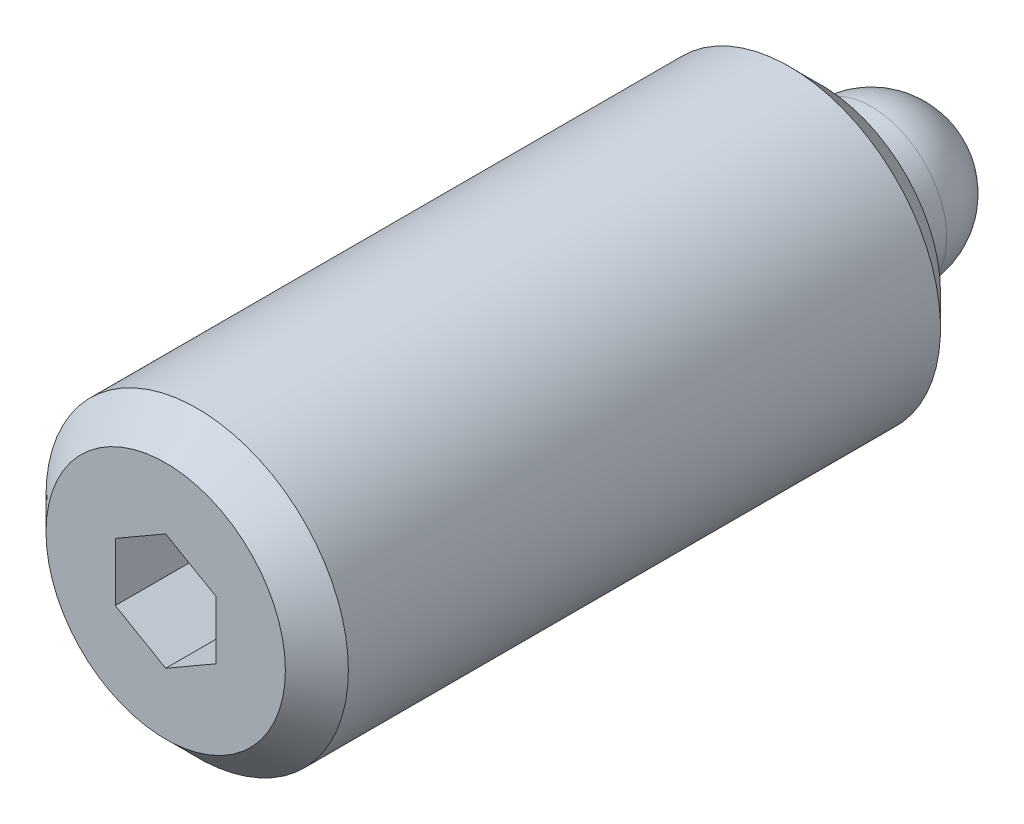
ISO-10303-21;
HEADER;
FILE_DESCRIPTION(('STEP AP214'),'2;1');
FILE_NAME('part.step','',(''),(''),'','','');
FILE_SCHEMA(('AUTOMOTIVE_DESIGN { 1 0 10303 214 1 1 1 1 }'));
ENDSEC;
DATA;
#1=APPLICATION_CONTEXT('core data for automotive mechanical design processes');
#2=APPLICATION_PROTOCOL_DEFINITION('international standard','automotive_design',2000,#1);
#3=PRODUCT_CONTEXT('',#1,'mechanical');
#4=PRODUCT('Part','Part','',(#3));
#5=PRODUCT_RELATED_PRODUCT_CATEGORY('part','',(#4));
#6=PRODUCT_DEFINITION_FORMATION('','',#4);
#7=PRODUCT_DEFINITION_CONTEXT('part definition',#1,'design');
#8=PRODUCT_DEFINITION('design','',#6,#7);
#9=PRODUCT_DEFINITION_SHAPE('','',#8);
#10=(LENGTH_UNIT() NAMED_UNIT(*) SI_UNIT(.MILLI.,.METRE.));
#11=(NAMED_UNIT(*) PLANE_ANGLE_UNIT() SI_UNIT($,.RADIAN.));
#12=(NAMED_UNIT(*) SI_UNIT($,.STERADIAN.) SOLID_ANGLE_UNIT());
#13=UNCERTAINTY_MEASURE_WITH_UNIT(LENGTH_MEASURE(1.E-05),#10,'distance_accuracy_value','');
#14=(GEOMETRIC_REPRESENTATION_CONTEXT(3) GLOBAL_UNCERTAINTY_ASSIGNED_CONTEXT((#13)) GLOBAL_UNIT_ASSIGNED_CONTEXT((#10,
#11,#12)) REPRESENTATION_CONTEXT('',''));
#15=CARTESIAN_POINT('',(0.,0.,0.));
#16=DIRECTION('',(0.,0.,1.));
#17=DIRECTION('',(1.,0.,0.));
#18=AXIS2_PLACEMENT_3D('',#15,#16,#17);
#19=CARTESIAN_POINT('',(0.,12.,62.));
#20=DIRECTION('',(0.,0.,1.));
#21=DIRECTION('',(1.,0.,0.));
#22=AXIS2_PLACEMENT_3D('',#19,#20,#21);
#23=PLANE('',#22);
#24=CARTESIAN_POINT('',(0.,0.,62.));
#25=DIRECTION('',(0.,0.,1.));
#26=DIRECTION('',(1.,0.,0.));
#27=AXIS2_PLACEMENT_3D('',#24,#25,#26);
#28=CIRCLE('',#27,9.5);
#29=CARTESIAN_POINT('',(9.5,0.,62.));
#30=VERTEX_POINT('',#29);
#31=EDGE_CURVE('E9',#30,#30,#28,.T.);
#32=ORIENTED_EDGE('',*,*,#31,.T.);
#33=EDGE_LOOP('',(#32));
#34=FACE_BOUND('',#33,.T.);
#35=DIRECTION('',(0.866025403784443,-0.499999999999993,0.));
#36=VECTOR('',#35,1.);
#37=CARTESIAN_POINT('',(-4.,-2.30940107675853,62.));
#38=LINE('',#37,#36);
#39=CARTESIAN_POINT('',(-4.,-2.30940107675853,62.));
#40=VERTEX_POINT('',#39);
#41=CARTESIAN_POINT('',(0.,-4.61880215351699,62.));
#42=VERTEX_POINT('',#41);
#43=EDGE_CURVE('E84',#40,#42,#38,.T.);
#44=ORIENTED_EDGE('',*,*,#43,.F.);
#45=DIRECTION('',(0.,1.,0.));
#46=VECTOR('',#45,1.);
#47=CARTESIAN_POINT('',(-4.,-2.30940107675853,62.));
#48=LINE('',#47,#46);
#49=CARTESIAN_POINT('',(-4.,2.30940107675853,62.));
#50=VERTEX_POINT('',#49);
#51=EDGE_CURVE('E29',#40,#50,#48,.T.);
#52=ORIENTED_EDGE('',*,*,#51,.T.);
#53=DIRECTION('',(0.866025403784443,0.499999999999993,0.));
#54=VECTOR('',#53,1.);
#55=CARTESIAN_POINT('',(-4.,2.30940107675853,62.));
#56=LINE('',#55,#54);
#57=CARTESIAN_POINT('',(0.,4.61880215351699,62.));
#58=VERTEX_POINT('',#57);
#59=EDGE_CURVE('E74',#50,#58,#56,.T.);
#60=ORIENTED_EDGE('',*,*,#59,.T.);
#61=DIRECTION('',(-0.866025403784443,0.499999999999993,0.));
#62=VECTOR('',#61,1.);
#63=CARTESIAN_POINT('',(4.,2.30940107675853,62.));
#64=LINE('',#63,#62);
#65=CARTESIAN_POINT('',(4.,2.30940107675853,62.));
#66=VERTEX_POINT('',#65);
#67=EDGE_CURVE('E79',#66,#58,#64,.T.);
#68=ORIENTED_EDGE('',*,*,#67,.F.);
#69=DIRECTION('',(0.,1.,0.));
#70=VECTOR('',#69,1.);
#71=CARTESIAN_POINT('',(4.,-2.30940107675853,62.));
#72=LINE('',#71,#70);
#73=CARTESIAN_POINT('',(4.,-2.30940107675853,62.));
#74=VERTEX_POINT('',#73);
#75=EDGE_CURVE('E88',#74,#66,#72,.T.);
#76=ORIENTED_EDGE('',*,*,#75,.F.);
#77=DIRECTION('',(-0.866025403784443,-0.499999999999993,0.));
#78=VECTOR('',#77,1.);
#79=CARTESIAN_POINT('',(4.,-2.30940107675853,62.));
#80=LINE('',#79,#78);
#81=EDGE_CURVE('E91',#74,#42,#80,.T.);
#82=ORIENTED_EDGE('',*,*,#81,.T.);
#83=EDGE_LOOP('',(#44,#52,#60,#68,#76,#82));
#84=FACE_BOUND('',#83,.T.);
#85=ADVANCED_FACE('F14',(#34,#84),#23,.T.);
#86=CARTESIAN_POINT('',(0.,0.,6.));
#87=DIRECTION('',(-1.,0.,0.));
#88=DIRECTION('',(0.,0.,1.));
#89=AXIS2_PLACEMENT_3D('',#86,#87,#88);
#90=SPHERICAL_SURFACE('',#89,6.);
#91=CARTESIAN_POINT('',(0.,0.,6.));
#92=DIRECTION('',(0.,0.,-1.));
#93=DIRECTION('',(-1.,0.,0.));
#94=AXIS2_PLACEMENT_3D('',#91,#92,#93);
#95=SPHERICAL_SURFACE('',#94,6.);
#96=CARTESIAN_POINT('',(0.,0.,6.));
#97=DIRECTION('',(0.,0.,-1.));
#98=DIRECTION('',(-1.,0.,0.));
#99=AXIS2_PLACEMENT_3D('',#96,#97,#98);
#100=CIRCLE('',#99,6.);
#101=CARTESIAN_POINT('',(-6.,0.,6.));
#102=VERTEX_POINT('',#101);
#103=EDGE_CURVE('E70',#102,#102,#100,.T.);
#104=ORIENTED_EDGE('',*,*,#103,.T.);
#105=EDGE_LOOP('',(#104));
#106=FACE_BOUND('',#105,.T.);
#107=ADVANCED_FACE('F152',(#106),#95,.T.);
#108=CARTESIAN_POINT('',(0.,0.,-4.));
#109=DIRECTION('',(0.,0.,-1.));
#110=DIRECTION('',(-1.,0.,0.));
#111=AXIS2_PLACEMENT_3D('',#108,#109,#110);
#112=CYLINDRICAL_SURFACE('',#111,12.);
#113=CARTESIAN_POINT('',(0.,0.,12.5));
#114=DIRECTION('',(0.,0.,-1.));
#115=DIRECTION('',(-1.,0.,0.));
#116=AXIS2_PLACEMENT_3D('',#113,#114,#115);
#117=CIRCLE('',#116,12.);
#118=CARTESIAN_POINT('',(-12.,0.,12.5));
#119=VERTEX_POINT('',#118);
#120=EDGE_CURVE('E22',#119,#119,#117,.F.);
#121=ORIENTED_EDGE('',*,*,#120,.T.);
#122=EDGE_LOOP('',(#121));
#123=FACE_BOUND('',#122,.T.);
#124=CARTESIAN_POINT('',(0.,0.,59.5));
#125=DIRECTION('',(0.,0.,1.));
#126=DIRECTION('',(1.,0.,0.));
#127=AXIS2_PLACEMENT_3D('',#124,#125,#126);
#128=CIRCLE('',#127,12.);
#129=CARTESIAN_POINT('',(12.,0.,59.5));
#130=VERTEX_POINT('',#129);
#131=EDGE_CURVE('E125',#130,#130,#128,.F.);
#132=ORIENTED_EDGE('',*,*,#131,.T.);
#133=EDGE_LOOP('',(#132));
#134=FACE_BOUND('',#133,.T.);
#135=ADVANCED_FACE('F130',(#123,#134),#112,.T.);
#136=CARTESIAN_POINT('',(0.,6.,10.));
#137=DIRECTION('',(0.,0.,-1.));
#138=DIRECTION('',(-1.,0.,0.));
#139=AXIS2_PLACEMENT_3D('',#136,#137,#138);
#140=PLANE('',#139);
#141=CARTESIAN_POINT('',(0.,0.,10.));
#142=DIRECTION('',(0.,0.,-1.));
#143=DIRECTION('',(-1.,0.,0.));
#144=AXIS2_PLACEMENT_3D('',#141,#142,#143);
#145=CIRCLE('',#144,9.5);
#146=CARTESIAN_POINT('',(-9.5,0.,10.));
#147=VERTEX_POINT('',#146);
#148=EDGE_CURVE('E122',#147,#147,#145,.T.);
#149=ORIENTED_EDGE('',*,*,#148,.T.);
#150=EDGE_LOOP('',(#149));
#151=FACE_BOUND('',#150,.T.);
#152=CARTESIAN_POINT('',(0.,0.,10.));
#153=DIRECTION('',(0.,0.,-1.));
#154=DIRECTION('',(-1.,0.,0.));
#155=AXIS2_PLACEMENT_3D('',#152,#153,#154);
#156=CIRCLE('',#155,6.);
#157=CARTESIAN_POINT('',(-6.,0.,10.));
#158=VERTEX_POINT('',#157);
#159=EDGE_CURVE('E119',#158,#158,#156,.T.);
#160=ORIENTED_EDGE('',*,*,#159,.F.);
#161=EDGE_LOOP('',(#160));
#162=FACE_BOUND('',#161,.T.);
#163=ADVANCED_FACE('F140',(#151,#162),#140,.T.);
#164=CARTESIAN_POINT('',(0.,0.,-4.));
#165=DIRECTION('',(0.,0.,-1.));
#166=DIRECTION('',(-1.,0.,0.));
#167=AXIS2_PLACEMENT_3D('',#164,#165,#166);
#168=CYLINDRICAL_SURFACE('',#167,6.);
#169=ORIENTED_EDGE('',*,*,#159,.T.);
#170=EDGE_LOOP('',(#169));
#171=FACE_BOUND('',#170,.T.);
#172=ORIENTED_EDGE('',*,*,#103,.F.);
#173=EDGE_LOOP('',(#172));
#174=FACE_BOUND('',#173,.T.);
#175=ADVANCED_FACE('F143',(#171,#174),#168,.T.);
#176=CARTESIAN_POINT('',(-4.,-2.30940107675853,52.));
#177=DIRECTION('',(1.,0.,0.));
#178=DIRECTION('',(0.,0.,-1.));
#179=AXIS2_PLACEMENT_3D('',#176,#177,#178);
#180=PLANE('',#179);
#181=DIRECTION('',(0.,0.,1.));
#182=VECTOR('',#181,1.);
#183=CARTESIAN_POINT('',(-4.,2.30940107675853,52.));
#184=LINE('',#183,#182);
#185=CARTESIAN_POINT('',(-4.,2.30940107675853,52.));
#186=VERTEX_POINT('',#185);
#187=EDGE_CURVE('E63',#186,#50,#184,.T.);
#188=ORIENTED_EDGE('',*,*,#187,.T.);
#189=ORIENTED_EDGE('',*,*,#51,.F.);
#190=DIRECTION('',(0.,0.,1.));
#191=VECTOR('',#190,1.);
#192=CARTESIAN_POINT('',(-4.,-2.30940107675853,52.));
#193=LINE('',#192,#191);
#194=CARTESIAN_POINT('',(-4.,-2.30940107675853,52.));
#195=VERTEX_POINT('',#194);
#196=EDGE_CURVE('E33',#195,#40,#193,.T.);
#197=ORIENTED_EDGE('',*,*,#196,.F.);
#198=DIRECTION('',(0.,1.,0.));
#199=VECTOR('',#198,1.);
#200=CARTESIAN_POINT('',(-4.,-2.30940107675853,52.));
#201=LINE('',#200,#199);
#202=EDGE_CURVE('E66',#195,#186,#201,.T.);
#203=ORIENTED_EDGE('',*,*,#202,.T.);
#204=EDGE_LOOP('',(#188,#189,#197,#203));
#205=FACE_BOUND('',#204,.T.);
#206=ADVANCED_FACE('F65',(#205),#180,.T.);
#207=CARTESIAN_POINT('',(-4.,2.30940107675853,52.));
#208=DIRECTION('',(0.499999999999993,-0.866025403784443,0.));
#209=DIRECTION('',(0.866025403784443,0.499999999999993,0.));
#210=AXIS2_PLACEMENT_3D('',#207,#208,#209);
#211=PLANE('',#210);
#212=DIRECTION('',(0.,0.,1.));
#213=VECTOR('',#212,1.);
#214=CARTESIAN_POINT('',(0.,4.61880215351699,52.));
#215=LINE('',#214,#213);
#216=CARTESIAN_POINT('',(0.,4.61880215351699,52.));
#217=VERTEX_POINT('',#216);
#218=EDGE_CURVE('E71',#217,#58,#215,.T.);
#219=ORIENTED_EDGE('',*,*,#218,.T.);
#220=ORIENTED_EDGE('',*,*,#59,.F.);
#221=ORIENTED_EDGE('',*,*,#187,.F.);
#222=DIRECTION('',(0.866025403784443,0.499999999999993,0.));
#223=VECTOR('',#222,1.);
#224=CARTESIAN_POINT('',(-4.,2.30940107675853,52.));
#225=LINE('',#224,#223);
#226=EDGE_CURVE('E95',#186,#217,#225,.T.);
#227=ORIENTED_EDGE('',*,*,#226,.T.);
#228=EDGE_LOOP('',(#219,#220,#221,#227));
#229=FACE_BOUND('',#228,.T.);
#230=ADVANCED_FACE('F75',(#229),#211,.T.);
#231=CARTESIAN_POINT('',(4.,2.30940107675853,52.));
#232=DIRECTION('',(0.499999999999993,0.866025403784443,0.));
#233=DIRECTION('',(-0.866025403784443,0.499999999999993,0.));
#234=AXIS2_PLACEMENT_3D('',#231,#232,#233);
#235=PLANE('',#234);
#236=DIRECTION('',(0.,0.,1.));
#237=VECTOR('',#236,1.);
#238=CARTESIAN_POINT('',(4.,2.30940107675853,52.));
#239=LINE('',#238,#237);
#240=CARTESIAN_POINT('',(4.,2.30940107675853,52.));
#241=VERTEX_POINT('',#240);
#242=EDGE_CURVE('E114',#241,#66,#239,.T.);
#243=ORIENTED_EDGE('',*,*,#242,.T.);
#244=ORIENTED_EDGE('',*,*,#67,.T.);
#245=ORIENTED_EDGE('',*,*,#218,.F.);
#246=DIRECTION('',(-0.866025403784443,0.499999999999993,0.));
#247=VECTOR('',#246,1.);
#248=CARTESIAN_POINT('',(4.,2.30940107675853,52.));
#249=LINE('',#248,#247);
#250=EDGE_CURVE('E97',#241,#217,#249,.T.);
#251=ORIENTED_EDGE('',*,*,#250,.F.);
#252=EDGE_LOOP('',(#243,#244,#245,#251));
#253=FACE_BOUND('',#252,.T.);
#254=ADVANCED_FACE('F167',(#253),#235,.F.);
#255=CARTESIAN_POINT('',(4.,-2.30940107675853,52.));
#256=DIRECTION('',(1.,0.,0.));
#257=DIRECTION('',(0.,0.,-1.));
#258=AXIS2_PLACEMENT_3D('',#255,#256,#257);
#259=PLANE('',#258);
#260=DIRECTION('',(0.,0.,1.));
#261=VECTOR('',#260,1.);
#262=CARTESIAN_POINT('',(4.,-2.30940107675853,52.));
#263=LINE('',#262,#261);
#264=CARTESIAN_POINT('',(4.,-2.30940107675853,52.));
#265=VERTEX_POINT('',#264);
#266=EDGE_CURVE('E112',#265,#74,#263,.T.);
#267=ORIENTED_EDGE('',*,*,#266,.T.);
#268=ORIENTED_EDGE('',*,*,#75,.T.);
#269=ORIENTED_EDGE('',*,*,#242,.F.);
#270=DIRECTION('',(0.,1.,0.));
#271=VECTOR('',#270,1.);
#272=CARTESIAN_POINT('',(4.,-2.30940107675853,52.));
#273=LINE('',#272,#271);
#274=EDGE_CURVE('E100',#265,#241,#273,.T.);
#275=ORIENTED_EDGE('',*,*,#274,.F.);
#276=EDGE_LOOP('',(#267,#268,#269,#275));
#277=FACE_BOUND('',#276,.T.);
#278=ADVANCED_FACE('F170',(#277),#259,.F.);
#279=CARTESIAN_POINT('',(4.,-2.30940107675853,52.));
#280=DIRECTION('',(-0.499999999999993,0.866025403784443,0.));
#281=DIRECTION('',(-0.866025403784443,-0.499999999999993,0.));
#282=AXIS2_PLACEMENT_3D('',#279,#280,#281);
#283=PLANE('',#282);
#284=DIRECTION('',(0.,0.,1.));
#285=VECTOR('',#284,1.);
#286=CARTESIAN_POINT('',(0.,-4.61880215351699,52.));
#287=LINE('',#286,#285);
#288=CARTESIAN_POINT('',(0.,-4.61880215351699,52.));
#289=VERTEX_POINT('',#288);
#290=EDGE_CURVE('E110',#289,#42,#287,.T.);
#291=ORIENTED_EDGE('',*,*,#290,.T.);
#292=ORIENTED_EDGE('',*,*,#81,.F.);
#293=ORIENTED_EDGE('',*,*,#266,.F.);
#294=DIRECTION('',(-0.866025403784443,-0.499999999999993,0.));
#295=VECTOR('',#294,1.);
#296=CARTESIAN_POINT('',(4.,-2.30940107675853,52.));
#297=LINE('',#296,#295);
#298=EDGE_CURVE('E103',#265,#289,#297,.T.);
#299=ORIENTED_EDGE('',*,*,#298,.T.);
#300=EDGE_LOOP('',(#291,#292,#293,#299));
#301=FACE_BOUND('',#300,.T.);
#302=ADVANCED_FACE('F174',(#301),#283,.T.);
#303=CARTESIAN_POINT('',(-4.,-2.30940107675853,52.));
#304=DIRECTION('',(-0.499999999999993,-0.866025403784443,0.));
#305=DIRECTION('',(0.866025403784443,-0.499999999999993,0.));
#306=AXIS2_PLACEMENT_3D('',#303,#304,#305);
#307=PLANE('',#306);
#308=DIRECTION('',(0.866025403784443,-0.499999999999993,0.));
#309=VECTOR('',#308,1.);
#310=CARTESIAN_POINT('',(-4.,-2.30940107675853,52.));
#311=LINE('',#310,#309);
#312=EDGE_CURVE('E106',#195,#289,#311,.T.);
#313=ORIENTED_EDGE('',*,*,#312,.F.);
#314=ORIENTED_EDGE('',*,*,#196,.T.);
#315=ORIENTED_EDGE('',*,*,#43,.T.);
#316=ORIENTED_EDGE('',*,*,#290,.F.);
#317=EDGE_LOOP('',(#313,#314,#315,#316));
#318=FACE_BOUND('',#317,.T.);
#319=ADVANCED_FACE('F137',(#318),#307,.F.);
#320=CARTESIAN_POINT('',(-4.,2.30940107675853,52.));
#321=DIRECTION('',(0.,0.,-1.));
#322=DIRECTION('',(-1.,0.,0.));
#323=AXIS2_PLACEMENT_3D('',#320,#321,#322);
#324=PLANE('',#323);
#325=ORIENTED_EDGE('',*,*,#202,.F.);
#326=ORIENTED_EDGE('',*,*,#312,.T.);
#327=ORIENTED_EDGE('',*,*,#298,.F.);
#328=ORIENTED_EDGE('',*,*,#274,.T.);
#329=ORIENTED_EDGE('',*,*,#250,.T.);
#330=ORIENTED_EDGE('',*,*,#226,.F.);
#331=EDGE_LOOP('',(#325,#326,#327,#328,#329,#330));
#332=FACE_BOUND('',#331,.T.);
#333=ADVANCED_FACE('F136',(#332),#324,.F.);
#334=CARTESIAN_POINT('',(0.,0.,10.));
#335=DIRECTION('',(0.,0.,1.));
#336=DIRECTION('',(1.,0.,0.));
#337=AXIS2_PLACEMENT_3D('',#334,#335,#336);
#338=CONICAL_SURFACE('',#337,9.5,0.785398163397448);
#339=ORIENTED_EDGE('',*,*,#120,.F.);
#340=EDGE_LOOP('',(#339));
#341=FACE_BOUND('',#340,.T.);
#342=ORIENTED_EDGE('',*,*,#148,.F.);
#343=EDGE_LOOP('',(#342));
#344=FACE_BOUND('',#343,.T.);
#345=ADVANCED_FACE('F133',(#341,#344),#338,.T.);
#346=CARTESIAN_POINT('',(0.,0.,59.5));
#347=DIRECTION('',(0.,0.,-1.));
#348=DIRECTION('',(-1.,0.,0.));
#349=AXIS2_PLACEMENT_3D('',#346,#347,#348);
#350=CONICAL_SURFACE('',#349,12.,0.785398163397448);
#351=ORIENTED_EDGE('',*,*,#31,.F.);
#352=EDGE_LOOP('',(#351));
#353=FACE_BOUND('',#352,.T.);
#354=ORIENTED_EDGE('',*,*,#131,.F.);
#355=EDGE_LOOP('',(#354));
#356=FACE_BOUND('',#355,.T.);
#357=ADVANCED_FACE('F16',(#353,#356),#350,.T.);
#358=CLOSED_SHELL('',(#85,#107,#135,#163,#175,#206,#230,#254,#278,#302,#319,#333,#345,#357));
#359=MANIFOLD_SOLID_BREP('B1',#358);
#360=ADVANCED_BREP_SHAPE_REPRESENTATION('',(#18,#359),#14);
#361=SHAPE_DEFINITION_REPRESENTATION(#9,#360);
ENDSEC;
END-ISO-10303-21;
